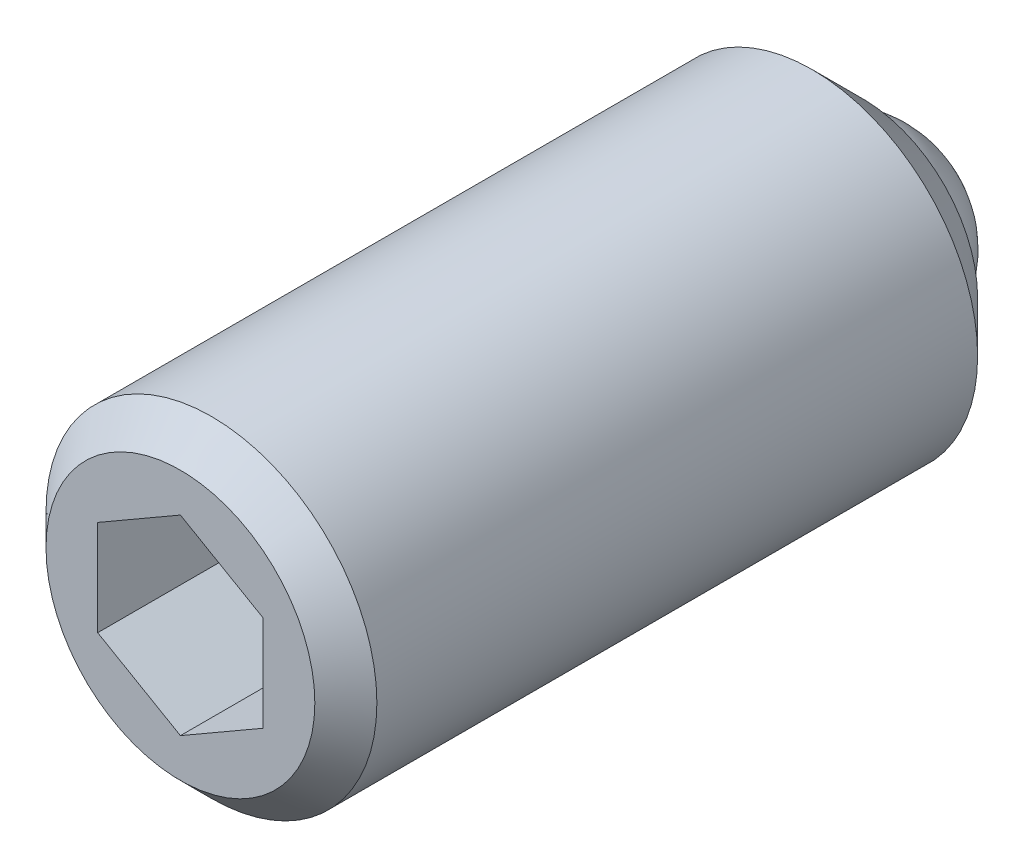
ISO-10303-21;
HEADER;
FILE_DESCRIPTION(('STEP AP214'),'2;1');
FILE_NAME('part.step','',(''),(''),'','','');
FILE_SCHEMA(('AUTOMOTIVE_DESIGN { 1 0 10303 214 1 1 1 1 }'));
ENDSEC;
DATA;
#1=APPLICATION_CONTEXT('core data for automotive mechanical design processes');
#2=APPLICATION_PROTOCOL_DEFINITION('international standard','automotive_design',2000,#1);
#3=PRODUCT_CONTEXT('',#1,'mechanical');
#4=PRODUCT('Part','Part','',(#3));
#5=PRODUCT_RELATED_PRODUCT_CATEGORY('part','',(#4));
#6=PRODUCT_DEFINITION_FORMATION('','',#4);
#7=PRODUCT_DEFINITION_CONTEXT('part definition',#1,'design');
#8=PRODUCT_DEFINITION('design','',#6,#7);
#9=PRODUCT_DEFINITION_SHAPE('','',#8);
#10=(LENGTH_UNIT() NAMED_UNIT(*) SI_UNIT(.MILLI.,.METRE.));
#11=(NAMED_UNIT(*) PLANE_ANGLE_UNIT() SI_UNIT($,.RADIAN.));
#12=(NAMED_UNIT(*) SI_UNIT($,.STERADIAN.) SOLID_ANGLE_UNIT());
#13=UNCERTAINTY_MEASURE_WITH_UNIT(LENGTH_MEASURE(1.E-05),#10,'distance_accuracy_value','');
#14=(GEOMETRIC_REPRESENTATION_CONTEXT(3) GLOBAL_UNCERTAINTY_ASSIGNED_CONTEXT((#13)) GLOBAL_UNIT_ASSIGNED_CONTEXT((#10,
#11,#12)) REPRESENTATION_CONTEXT('',''));
#15=CARTESIAN_POINT('',(0.,0.,0.));
#16=DIRECTION('',(0.,0.,1.));
#17=DIRECTION('',(1.,0.,0.));
#18=AXIS2_PLACEMENT_3D('',#15,#16,#17);
#19=CARTESIAN_POINT('',(3.999999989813,-4.67422772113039,30.500000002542));
#20=DIRECTION('',(3.34000044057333E-10,-2.58019878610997E-10,-1.));
#21=DIRECTION('',(-1.,0.,-3.34000044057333E-10));
#22=AXIS2_PLACEMENT_3D('',#19,#20,#21);
#23=PLANE('',#22);
#24=DIRECTION('',(-0.866025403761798,-0.500000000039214,-1.60242583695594E-10));
#25=VECTOR('',#24,1.);
#26=CARTESIAN_POINT('',(-2.000000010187,3.46410167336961,30.4999999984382));
#27=LINE('',#26,#25);
#28=CARTESIAN_POINT('',(-1.13157802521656E-08,4.61880221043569,30.4999999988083));
#29=VERTEX_POINT('',#28);
#30=CARTESIAN_POINT('',(-4.000000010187,2.30940113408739,30.4999999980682));
#31=VERTEX_POINT('',#30);
#32=EDGE_CURVE('E95',#29,#31,#27,.T.);
#33=ORIENTED_EDGE('',*,*,#32,.T.);
#34=DIRECTION('',(0.,-1.,2.58019878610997E-10));
#35=VECTOR('',#34,1.);
#36=CARTESIAN_POINT('',(-4.000000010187,5.7869607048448E-08,30.499999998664));
#37=LINE('',#36,#35);
#38=CARTESIAN_POINT('',(-4.00000001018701,-2.30940101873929,30.4999999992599));
#39=VERTEX_POINT('',#38);
#40=EDGE_CURVE('E97',#31,#39,#37,.T.);
#41=ORIENTED_EDGE('',*,*,#40,.T.);
#42=DIRECTION('',(0.866025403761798,-0.500000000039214,4.18262462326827E-10));
#43=VECTOR('',#42,1.);
#44=CARTESIAN_POINT('',(-2.000000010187,-3.4641015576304,30.5000000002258));
#45=LINE('',#44,#43);
#46=CARTESIAN_POINT('',(-9.05822223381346E-09,-4.61880209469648,30.5000000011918));
#47=VERTEX_POINT('',#46);
#48=EDGE_CURVE('E72',#39,#47,#45,.T.);
#49=ORIENTED_EDGE('',*,*,#48,.T.);
#50=DIRECTION('',(0.866025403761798,0.500000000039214,1.60242583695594E-10));
#51=VECTOR('',#50,1.);
#52=CARTESIAN_POINT('',(1.999999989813,-3.4641015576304,30.5000000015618));
#53=LINE('',#52,#51);
#54=CARTESIAN_POINT('',(3.999999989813,-2.30940101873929,30.5000000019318));
#55=VERTEX_POINT('',#54);
#56=EDGE_CURVE('E71',#47,#55,#53,.T.);
#57=ORIENTED_EDGE('',*,*,#56,.T.);
#58=DIRECTION('',(0.,1.,-2.58019878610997E-10));
#59=VECTOR('',#58,1.);
#60=CARTESIAN_POINT('',(3.999999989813,5.78696055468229E-08,30.500000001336));
#61=LINE('',#60,#59);
#62=CARTESIAN_POINT('',(3.999999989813,2.30940113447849,30.5000000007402));
#63=VERTEX_POINT('',#62);
#64=EDGE_CURVE('E100',#55,#63,#61,.T.);
#65=ORIENTED_EDGE('',*,*,#64,.T.);
#66=DIRECTION('',(-0.866025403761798,0.500000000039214,-4.18262462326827E-10));
#67=VECTOR('',#66,1.);
#68=CARTESIAN_POINT('',(1.999999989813,3.46410167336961,30.4999999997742));
#69=LINE('',#68,#67);
#70=EDGE_CURVE('E105',#63,#29,#69,.T.);
#71=ORIENTED_EDGE('',*,*,#70,.T.);
#72=EDGE_LOOP('',(#33,#41,#49,#57,#65,#71));
#73=FACE_BOUND('',#72,.T.);
#74=ADVANCED_FACE('F14',(#73),#23,.F.);
#75=CARTESIAN_POINT('',(-4.000000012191,-2.30940101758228,36.4999999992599));
#76=DIRECTION('',(-1.,0.,-3.34000044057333E-10));
#77=DIRECTION('',(0.,1.,-2.58019878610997E-10));
#78=AXIS2_PLACEMENT_3D('',#75,#76,#77);
#79=PLANE('',#78);
#80=DIRECTION('',(3.34000044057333E-10,-2.58019878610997E-10,-1.));
#81=VECTOR('',#80,1.);
#82=CARTESIAN_POINT('',(-4.000000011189,-2.30940101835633,33.4999999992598));
#83=LINE('',#82,#81);
#84=CARTESIAN_POINT('',(-4.00000001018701,-2.30940101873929,36.4999999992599));
#85=VERTEX_POINT('',#84);
#86=EDGE_CURVE('E62',#85,#39,#83,.T.);
#87=ORIENTED_EDGE('',*,*,#86,.T.);
#88=ORIENTED_EDGE('',*,*,#40,.F.);
#89=DIRECTION('',(-3.34000044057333E-10,2.58019878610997E-10,1.));
#90=VECTOR('',#89,1.);
#91=CARTESIAN_POINT('',(-4.000000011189,2.30940113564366,33.4999999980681));
#92=LINE('',#91,#90);
#93=CARTESIAN_POINT('',(-4.00000001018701,2.30940113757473,36.4999999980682));
#94=VERTEX_POINT('',#93);
#95=EDGE_CURVE('E93',#31,#94,#92,.T.);
#96=ORIENTED_EDGE('',*,*,#95,.T.);
#97=DIRECTION('',(0.,-1.,2.58019878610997E-10));
#98=VECTOR('',#97,1.);
#99=CARTESIAN_POINT('',(-4.000000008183,5.9417726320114E-08,36.499999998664));
#100=LINE('',#99,#98);
#101=EDGE_CURVE('E50',#94,#85,#100,.T.);
#102=ORIENTED_EDGE('',*,*,#101,.T.);
#103=EDGE_LOOP('',(#87,#88,#96,#102));
#104=FACE_BOUND('',#103,.T.);
#105=ADVANCED_FACE('F125',(#104),#79,.F.);
#106=CARTESIAN_POINT('',(-1.21910024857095E-08,-4.61880209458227,36.5000000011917));
#107=DIRECTION('',(-0.500000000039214,-0.866025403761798,5.64517475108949E-11));
#108=DIRECTION('',(-0.866025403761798,0.500000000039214,-4.18262462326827E-10));
#109=AXIS2_PLACEMENT_3D('',#106,#107,#108);
#110=PLANE('',#109);
#111=DIRECTION('',(3.34000044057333E-10,-2.58019878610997E-10,-1.));
#112=VECTOR('',#111,1.);
#113=CARTESIAN_POINT('',(-1.11890023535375E-08,-4.61880209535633,33.5000000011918));
#114=LINE('',#113,#112);
#115=CARTESIAN_POINT('',(-1.21910022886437E-08,-4.61880209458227,36.5000000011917));
#116=VERTEX_POINT('',#115);
#117=EDGE_CURVE('E60',#116,#47,#114,.T.);
#118=ORIENTED_EDGE('',*,*,#117,.T.);
#119=ORIENTED_EDGE('',*,*,#48,.F.);
#120=ORIENTED_EDGE('',*,*,#86,.F.);
#121=DIRECTION('',(-0.866025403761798,0.500000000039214,-4.18262462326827E-10));
#122=VECTOR('',#121,1.);
#123=CARTESIAN_POINT('',(-1.21910024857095E-08,-4.61880209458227,36.5000000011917));
#124=LINE('',#123,#122);
#125=EDGE_CURVE('E18',#85,#116,#124,.F.);
#126=ORIENTED_EDGE('',*,*,#125,.T.);
#127=EDGE_LOOP('',(#118,#119,#120,#126));
#128=FACE_BOUND('',#127,.T.);
#129=ADVANCED_FACE('F57',(#128),#110,.F.);
#130=CARTESIAN_POINT('',(3.999999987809,-2.30940101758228,36.5000000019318));
#131=DIRECTION('',(0.500000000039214,-0.866025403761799,3.90451791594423E-10));
#132=DIRECTION('',(-0.866025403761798,-0.500000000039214,-1.60242583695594E-10));
#133=AXIS2_PLACEMENT_3D('',#130,#131,#132);
#134=PLANE('',#133);
#135=DIRECTION('',(3.34000044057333E-10,-2.58019878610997E-10,-1.));
#136=VECTOR('',#135,1.);
#137=CARTESIAN_POINT('',(3.999999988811,-2.30940101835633,33.5000000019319));
#138=LINE('',#137,#136);
#139=CARTESIAN_POINT('',(3.999999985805,-2.30940101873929,36.5000000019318));
#140=VERTEX_POINT('',#139);
#141=EDGE_CURVE('E99',#140,#55,#138,.T.);
#142=ORIENTED_EDGE('',*,*,#141,.T.);
#143=ORIENTED_EDGE('',*,*,#56,.F.);
#144=ORIENTED_EDGE('',*,*,#117,.F.);
#145=DIRECTION('',(-0.866025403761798,-0.500000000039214,-1.60242583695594E-10));
#146=VECTOR('',#145,1.);
#147=CARTESIAN_POINT('',(3.999999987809,-2.30940101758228,36.5000000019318));
#148=LINE('',#147,#146);
#149=EDGE_CURVE('E65',#116,#140,#148,.F.);
#150=ORIENTED_EDGE('',*,*,#149,.T.);
#151=EDGE_LOOP('',(#142,#143,#144,#150));
#152=FACE_BOUND('',#151,.T.);
#153=ADVANCED_FACE('F68',(#152),#134,.F.);
#154=CARTESIAN_POINT('',(3.999999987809,2.30940113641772,36.5000000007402));
#155=DIRECTION('',(1.,0.,3.34000044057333E-10));
#156=DIRECTION('',(0.,-1.,2.58019878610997E-10));
#157=AXIS2_PLACEMENT_3D('',#154,#155,#156);
#158=PLANE('',#157);
#159=DIRECTION('',(3.34000044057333E-10,-2.58019878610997E-10,-1.));
#160=VECTOR('',#159,1.);
#161=CARTESIAN_POINT('',(3.999999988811,2.30940113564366,33.5000000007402));
#162=LINE('',#161,#160);
#163=CARTESIAN_POINT('',(3.999999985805,2.30940113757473,36.5000000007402));
#164=VERTEX_POINT('',#163);
#165=EDGE_CURVE('E106',#164,#63,#162,.T.);
#166=ORIENTED_EDGE('',*,*,#165,.T.);
#167=ORIENTED_EDGE('',*,*,#64,.F.);
#168=ORIENTED_EDGE('',*,*,#141,.F.);
#169=DIRECTION('',(0.,1.,-2.58019878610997E-10));
#170=VECTOR('',#169,1.);
#171=CARTESIAN_POINT('',(3.999999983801,5.94177248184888E-08,36.500000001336));
#172=LINE('',#171,#170);
#173=EDGE_CURVE('E78',#140,#164,#172,.T.);
#174=ORIENTED_EDGE('',*,*,#173,.T.);
#175=EDGE_LOOP('',(#166,#167,#168,#174));
#176=FACE_BOUND('',#175,.T.);
#177=ADVANCED_FACE('F133',(#176),#158,.F.);
#178=CARTESIAN_POINT('',(-1.21910007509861E-08,4.61880221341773,36.4999999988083));
#179=DIRECTION('',(0.500000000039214,0.866025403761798,-5.64517475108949E-11));
#180=DIRECTION('',(0.866025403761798,-0.500000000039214,4.18262462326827E-10));
#181=AXIS2_PLACEMENT_3D('',#178,#179,#180);
#182=PLANE('',#181);
#183=DIRECTION('',(3.34000044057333E-10,-2.58019878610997E-10,-1.));
#184=VECTOR('',#183,1.);
#185=CARTESIAN_POINT('',(-1.11890006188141E-08,4.61880221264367,33.4999999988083));
#186=LINE('',#185,#184);
#187=CARTESIAN_POINT('',(-1.21910009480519E-08,4.61880221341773,36.4999999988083));
#188=VERTEX_POINT('',#187);
#189=EDGE_CURVE('E102',#188,#29,#186,.T.);
#190=ORIENTED_EDGE('',*,*,#189,.T.);
#191=ORIENTED_EDGE('',*,*,#70,.F.);
#192=ORIENTED_EDGE('',*,*,#165,.F.);
#193=DIRECTION('',(0.866025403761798,-0.500000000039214,4.18262462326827E-10));
#194=VECTOR('',#193,1.);
#195=CARTESIAN_POINT('',(-1.21910007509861E-08,4.61880221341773,36.4999999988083));
#196=LINE('',#195,#194);
#197=EDGE_CURVE('E79',#164,#188,#196,.F.);
#198=ORIENTED_EDGE('',*,*,#197,.T.);
#199=EDGE_LOOP('',(#190,#191,#192,#198));
#200=FACE_BOUND('',#199,.T.);
#201=ADVANCED_FACE('F136',(#200),#182,.F.);
#202=CARTESIAN_POINT('',(-4.000000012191,2.30940113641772,36.4999999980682));
#203=DIRECTION('',(-0.500000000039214,0.866025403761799,-3.90451791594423E-10));
#204=DIRECTION('',(0.866025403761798,0.500000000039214,1.60242583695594E-10));
#205=AXIS2_PLACEMENT_3D('',#202,#203,#204);
#206=PLANE('',#205);
#207=ORIENTED_EDGE('',*,*,#95,.F.);
#208=ORIENTED_EDGE('',*,*,#32,.F.);
#209=ORIENTED_EDGE('',*,*,#189,.F.);
#210=DIRECTION('',(0.866025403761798,0.500000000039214,1.60242583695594E-10));
#211=VECTOR('',#210,1.);
#212=CARTESIAN_POINT('',(-4.000000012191,2.30940113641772,36.4999999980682));
#213=LINE('',#212,#211);
#214=EDGE_CURVE('E83',#188,#94,#213,.F.);
#215=ORIENTED_EDGE('',*,*,#214,.T.);
#216=EDGE_LOOP('',(#207,#208,#209,#215));
#217=FACE_BOUND('',#216,.T.);
#218=ADVANCED_FACE('F140',(#217),#206,.F.);
#219=CARTESIAN_POINT('',(6.577999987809,-6.60063463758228,36.5000000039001));
#220=DIRECTION('',(3.34000044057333E-10,-2.58019878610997E-10,-1.));
#221=DIRECTION('',(-1.,0.,-3.34000044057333E-10));
#222=AXIS2_PLACEMENT_3D('',#219,#220,#221);
#223=PLANE('',#222);
#224=ORIENTED_EDGE('',*,*,#197,.F.);
#225=ORIENTED_EDGE('',*,*,#173,.F.);
#226=ORIENTED_EDGE('',*,*,#149,.F.);
#227=ORIENTED_EDGE('',*,*,#125,.F.);
#228=ORIENTED_EDGE('',*,*,#101,.F.);
#229=ORIENTED_EDGE('',*,*,#214,.F.);
#230=EDGE_LOOP('',(#224,#225,#226,#227,#228,#229));
#231=FACE_BOUND('',#230,.T.);
#232=CARTESIAN_POINT('',(-1.21910016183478E-08,5.94177255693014E-08,36.5));
#233=DIRECTION('',(3.34000044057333E-10,-2.58019878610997E-10,-1.));
#234=DIRECTION('',(-1.,0.,-3.34000044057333E-10));
#235=AXIS2_PLACEMENT_3D('',#232,#233,#234);
#236=CIRCLE('',#235,6.5);
#237=CARTESIAN_POINT('',(-6.500000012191,5.94177267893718E-08,36.499999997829));
#238=VERTEX_POINT('',#237);
#239=EDGE_CURVE('E86',#238,#238,#236,.T.);
#240=ORIENTED_EDGE('',*,*,#239,.F.);
#241=EDGE_LOOP('',(#240));
#242=FACE_BOUND('',#241,.T.);
#243=ADVANCED_FACE('F76',(#231,#242),#223,.F.);
#244=CARTESIAN_POINT('',(-1.21910016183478E-08,5.94177255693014E-08,36.5));
#245=DIRECTION('',(3.34000044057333E-10,-2.58019878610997E-10,-1.));
#246=DIRECTION('',(-1.,0.,-3.34000044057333E-10));
#247=AXIS2_PLACEMENT_3D('',#244,#245,#246);
#248=CONICAL_SURFACE('',#247,6.5,0.785398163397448);
#249=CARTESIAN_POINT('',(-1.16900015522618E-08,5.90306957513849E-08,35.));
#250=DIRECTION('',(-3.34000044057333E-10,2.58019878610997E-10,1.));
#251=DIRECTION('',(1.,0.,3.34000044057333E-10));
#252=AXIS2_PLACEMENT_3D('',#249,#250,#251);
#253=CIRCLE('',#252,8.);
#254=CARTESIAN_POINT('',(7.99999998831,5.90306942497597E-08,35.000000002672));
#255=VERTEX_POINT('',#254);
#256=EDGE_CURVE('E89',#255,#255,#253,.F.);
#257=ORIENTED_EDGE('',*,*,#256,.F.);
#258=EDGE_LOOP('',(#257));
#259=FACE_BOUND('',#258,.T.);
#260=ORIENTED_EDGE('',*,*,#239,.T.);
#261=EDGE_LOOP('',(#260));
#262=FACE_BOUND('',#261,.T.);
#263=ADVANCED_FACE('F145',(#259,#262),#248,.T.);
#264=CARTESIAN_POINT('',(-1.98730027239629E-09,5.15352182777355E-08,5.95));
#265=DIRECTION('',(-3.34000044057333E-10,2.58019661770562E-10,1.));
#266=DIRECTION('',(0.,1.,-2.58019661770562E-10));
#267=AXIS2_PLACEMENT_3D('',#264,#265,#266);
#268=CYLINDRICAL_SURFACE('',#267,8.);
#269=ORIENTED_EDGE('',*,*,#256,.T.);
#270=EDGE_LOOP('',(#269));
#271=FACE_BOUND('',#270,.T.);
#272=CARTESIAN_POINT('',(-1.98730027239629E-09,5.15352182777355E-08,5.95));
#273=DIRECTION('',(-3.34000044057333E-10,2.58019878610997E-10,1.));
#274=DIRECTION('',(1.,0.,3.34000044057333E-10));
#275=AXIS2_PLACEMENT_3D('',#272,#273,#274);
#276=CIRCLE('',#275,8.);
#277=CARTESIAN_POINT('',(7.9999999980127,5.15352167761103E-08,5.950000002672));
#278=VERTEX_POINT('',#277);
#279=EDGE_CURVE('E91',#278,#278,#276,.F.);
#280=ORIENTED_EDGE('',*,*,#279,.F.);
#281=EDGE_LOOP('',(#280));
#282=FACE_BOUND('',#281,.T.);
#283=ADVANCED_FACE('F151',(#271,#282),#268,.T.);
#284=CARTESIAN_POINT('',(-1.16900016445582E-09,5.09030695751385E-08,3.5));
#285=DIRECTION('',(-3.34000044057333E-10,2.58019878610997E-10,1.));
#286=DIRECTION('',(1.,0.,3.34000044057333E-10));
#287=AXIS2_PLACEMENT_3D('',#284,#285,#286);
#288=CONICAL_SURFACE('',#287,5.55,0.785398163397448);
#289=ORIENTED_EDGE('',*,*,#279,.T.);
#290=EDGE_LOOP('',(#289));
#291=FACE_BOUND('',#290,.T.);
#292=CARTESIAN_POINT('',(-1.16900016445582E-09,5.09030695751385E-08,3.5));
#293=DIRECTION('',(-3.34000044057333E-10,2.58019878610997E-10,1.));
#294=DIRECTION('',(1.,0.,3.34000044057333E-10));
#295=AXIS2_PLACEMENT_3D('',#292,#293,#294);
#296=CIRCLE('',#295,5.55);
#297=CARTESIAN_POINT('',(5.549999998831,5.0903068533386E-08,3.5000000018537));
#298=VERTEX_POINT('',#297);
#299=EDGE_CURVE('E24',#298,#298,#296,.T.);
#300=ORIENTED_EDGE('',*,*,#299,.T.);
#301=EDGE_LOOP('',(#300));
#302=FACE_BOUND('',#301,.T.);
#303=ADVANCED_FACE('F121',(#291,#302),#288,.T.);
#304=CARTESIAN_POINT('',(-5.616600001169,-5.63592649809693,3.49999999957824));
#305=DIRECTION('',(-3.34000044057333E-10,2.58019878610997E-10,1.));
#306=DIRECTION('',(1.,0.,3.34000044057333E-10));
#307=AXIS2_PLACEMENT_3D('',#304,#305,#306);
#308=PLANE('',#307);
#309=CARTESIAN_POINT('',(-1.16900016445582E-09,5.09030695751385E-08,3.5));
#310=DIRECTION('',(-3.34000044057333E-10,2.58019878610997E-10,1.));
#311=DIRECTION('',(1.,0.,3.34000044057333E-10));
#312=AXIS2_PLACEMENT_3D('',#309,#310,#311);
#313=CIRCLE('',#312,4.76969600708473);
#314=CARTESIAN_POINT('',(4.76969600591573,5.09030686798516E-08,3.50000000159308));
#315=VERTEX_POINT('',#314);
#316=EDGE_CURVE('E9',#315,#315,#313,.F.);
#317=ORIENTED_EDGE('',*,*,#316,.F.);
#318=EDGE_LOOP('',(#317));
#319=FACE_BOUND('',#318,.T.);
#320=ORIENTED_EDGE('',*,*,#299,.F.);
#321=EDGE_LOOP('',(#320));
#322=FACE_BOUND('',#321,.T.);
#323=ADVANCED_FACE('F16',(#319,#322),#308,.F.);
#324=CARTESIAN_POINT('',(-1.67000023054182E-09,5.1290099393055E-08,5.));
#325=DIRECTION('',(-3.34000044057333E-10,2.58019878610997E-10,1.));
#326=DIRECTION('',(0.,1.,-2.58019878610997E-10));
#327=AXIS2_PLACEMENT_3D('',#324,#325,#326);
#328=SPHERICAL_SURFACE('',#327,5.);
#329=CARTESIAN_POINT('',(0.,0.,0.));
#330=VERTEX_POINT('',#329);
#331=VERTEX_LOOP('',#330);
#332=FACE_BOUND('',#331,.T.);
#333=ORIENTED_EDGE('',*,*,#316,.T.);
#334=EDGE_LOOP('',(#333));
#335=FACE_BOUND('',#334,.T.);
#336=ADVANCED_FACE('F117',(#332,#335),#328,.T.);
#337=CLOSED_SHELL('',(#74,#105,#129,#153,#177,#201,#218,#243,#263,#283,#303,#323,#336));
#338=MANIFOLD_SOLID_BREP('B1',#337);
#339=ADVANCED_BREP_SHAPE_REPRESENTATION('',(#18,#338),#14);
#340=SHAPE_DEFINITION_REPRESENTATION(#9,#339);
ENDSEC;
END-ISO-10303-21;
